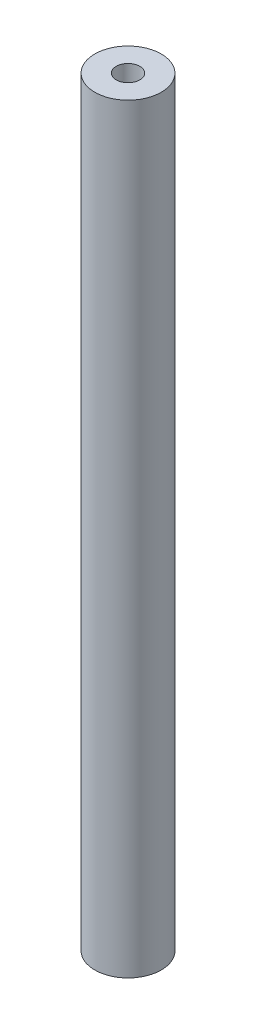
ISO-10303-21;
HEADER;
FILE_DESCRIPTION(('STEP AP214'),'2;1');
FILE_NAME('part.step','',(''),(''),'','','');
FILE_SCHEMA(('AUTOMOTIVE_DESIGN { 1 0 10303 214 1 1 1 1 }'));
ENDSEC;
DATA;
#1=APPLICATION_CONTEXT('core data for automotive mechanical design processes');
#2=APPLICATION_PROTOCOL_DEFINITION('international standard','automotive_design',2000,#1);
#3=PRODUCT_CONTEXT('',#1,'mechanical');
#4=PRODUCT('Part','Part','',(#3));
#5=PRODUCT_RELATED_PRODUCT_CATEGORY('part','',(#4));
#6=PRODUCT_DEFINITION_FORMATION('','',#4);
#7=PRODUCT_DEFINITION_CONTEXT('part definition',#1,'design');
#8=PRODUCT_DEFINITION('design','',#6,#7);
#9=PRODUCT_DEFINITION_SHAPE('','',#8);
#10=(LENGTH_UNIT() NAMED_UNIT(*) SI_UNIT(.MILLI.,.METRE.));
#11=(NAMED_UNIT(*) PLANE_ANGLE_UNIT() SI_UNIT($,.RADIAN.));
#12=(NAMED_UNIT(*) SI_UNIT($,.STERADIAN.) SOLID_ANGLE_UNIT());
#13=UNCERTAINTY_MEASURE_WITH_UNIT(LENGTH_MEASURE(1.E-05),#10,'distance_accuracy_value','');
#14=(GEOMETRIC_REPRESENTATION_CONTEXT(3) GLOBAL_UNCERTAINTY_ASSIGNED_CONTEXT((#13)) GLOBAL_UNIT_ASSIGNED_CONTEXT((#10,
#11,#12)) REPRESENTATION_CONTEXT('',''));
#15=CARTESIAN_POINT('',(0.,0.,0.));
#16=DIRECTION('',(0.,0.,1.));
#17=DIRECTION('',(1.,0.,0.));
#18=AXIS2_PLACEMENT_3D('',#15,#16,#17);
#19=CARTESIAN_POINT('',(-35.,122.727922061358,-148.));
#20=DIRECTION('',(0.,-1.,0.));
#21=DIRECTION('',(0.,0.,-1.));
#22=AXIS2_PLACEMENT_3D('',#19,#20,#21);
#23=CYLINDRICAL_SURFACE('',#22,4.50000000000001);
#24=CARTESIAN_POINT('',(-35.,6.99999999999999,-148.));
#25=DIRECTION('',(0.,1.,0.));
#26=DIRECTION('',(0.,0.,1.));
#27=AXIS2_PLACEMENT_3D('',#24,#25,#26);
#28=CIRCLE('',#27,4.50000000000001);
#29=CARTESIAN_POINT('',(-35.,6.99999999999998,-152.5));
#30=VERTEX_POINT('',#29);
#31=EDGE_CURVE('E43',#30,#30,#28,.T.);
#32=CARTESIAN_POINT('',(-35.,110.,-148.));
#33=DIRECTION('',(0.,1.,0.));
#34=DIRECTION('',(0.,0.,1.));
#35=AXIS2_PLACEMENT_3D('',#32,#33,#34);
#36=CIRCLE('',#35,4.50000000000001);
#37=CARTESIAN_POINT('',(-35.,110.,-152.5));
#38=VERTEX_POINT('',#37);
#39=EDGE_CURVE('E12',#38,#38,#36,.T.);
#40=CARTESIAN_POINT('',(-35.,6.99999999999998,-152.5));
#41=CARTESIAN_POINT('',(-35.,8.07291666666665,-152.5));
#42=CARTESIAN_POINT('',(-35.,9.14583333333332,-152.5));
#43=CARTESIAN_POINT('',(-35.,11.2916666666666,-152.5));
#44=CARTESIAN_POINT('',(-35.,12.3645833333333,-152.5));
#45=CARTESIAN_POINT('',(-35.,14.5104166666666,-152.5));
#46=CARTESIAN_POINT('',(-35.,15.5833333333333,-152.5));
#47=CARTESIAN_POINT('',(-35.,17.7291666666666,-152.5));
#48=CARTESIAN_POINT('',(-35.,18.8020833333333,-152.5));
#49=CARTESIAN_POINT('',(-35.,20.9479166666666,-152.5));
#50=CARTESIAN_POINT('',(-35.,22.0208333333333,-152.5));
#51=CARTESIAN_POINT('',(-35.,24.1666666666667,-152.5));
#52=CARTESIAN_POINT('',(-35.,25.2395833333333,-152.5));
#53=CARTESIAN_POINT('',(-35.,27.3854166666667,-152.5));
#54=CARTESIAN_POINT('',(-35.,28.4583333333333,-152.5));
#55=CARTESIAN_POINT('',(-35.,30.6041666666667,-152.5));
#56=CARTESIAN_POINT('',(-35.,31.6770833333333,-152.5));
#57=CARTESIAN_POINT('',(-35.,33.8229166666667,-152.5));
#58=CARTESIAN_POINT('',(-35.,34.8958333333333,-152.5));
#59=CARTESIAN_POINT('',(-35.,37.0416666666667,-152.5));
#60=CARTESIAN_POINT('',(-35.,38.1145833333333,-152.5));
#61=CARTESIAN_POINT('',(-35.,40.2604166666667,-152.5));
#62=CARTESIAN_POINT('',(-35.,41.3333333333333,-152.5));
#63=CARTESIAN_POINT('',(-35.,43.4791666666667,-152.5));
#64=CARTESIAN_POINT('',(-35.,44.5520833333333,-152.5));
#65=CARTESIAN_POINT('',(-35.,46.6979166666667,-152.5));
#66=CARTESIAN_POINT('',(-35.,47.7708333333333,-152.5));
#67=CARTESIAN_POINT('',(-35.,49.9166666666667,-152.5));
#68=CARTESIAN_POINT('',(-35.,50.9895833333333,-152.5));
#69=CARTESIAN_POINT('',(-35.,53.1354166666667,-152.5));
#70=CARTESIAN_POINT('',(-35.,54.2083333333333,-152.5));
#71=CARTESIAN_POINT('',(-35.,56.3541666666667,-152.5));
#72=CARTESIAN_POINT('',(-35.,57.4270833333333,-152.5));
#73=CARTESIAN_POINT('',(-35.,59.5729166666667,-152.5));
#74=CARTESIAN_POINT('',(-35.,60.6458333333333,-152.5));
#75=CARTESIAN_POINT('',(-35.,62.7916666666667,-152.5));
#76=CARTESIAN_POINT('',(-35.,63.8645833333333,-152.5));
#77=CARTESIAN_POINT('',(-35.,66.0104166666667,-152.5));
#78=CARTESIAN_POINT('',(-35.,67.0833333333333,-152.5));
#79=CARTESIAN_POINT('',(-35.,69.2291666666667,-152.5));
#80=CARTESIAN_POINT('',(-35.,70.3020833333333,-152.5));
#81=CARTESIAN_POINT('',(-35.,72.4479166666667,-152.5));
#82=CARTESIAN_POINT('',(-35.,73.5208333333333,-152.5));
#83=CARTESIAN_POINT('',(-35.,75.6666666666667,-152.5));
#84=CARTESIAN_POINT('',(-35.,76.7395833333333,-152.5));
#85=CARTESIAN_POINT('',(-35.,78.8854166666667,-152.5));
#86=CARTESIAN_POINT('',(-35.,79.9583333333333,-152.5));
#87=CARTESIAN_POINT('',(-35.,82.1041666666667,-152.5));
#88=CARTESIAN_POINT('',(-35.,83.1770833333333,-152.5));
#89=CARTESIAN_POINT('',(-35.,85.3229166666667,-152.5));
#90=CARTESIAN_POINT('',(-35.,86.3958333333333,-152.5));
#91=CARTESIAN_POINT('',(-35.,88.5416666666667,-152.5));
#92=CARTESIAN_POINT('',(-35.,89.6145833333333,-152.5));
#93=CARTESIAN_POINT('',(-35.,91.7604166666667,-152.5));
#94=CARTESIAN_POINT('',(-35.,92.8333333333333,-152.5));
#95=CARTESIAN_POINT('',(-35.,94.9791666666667,-152.5));
#96=CARTESIAN_POINT('',(-35.,96.0520833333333,-152.5));
#97=CARTESIAN_POINT('',(-35.,98.1979166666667,-152.5));
#98=CARTESIAN_POINT('',(-35.,99.2708333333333,-152.5));
#99=CARTESIAN_POINT('',(-35.,101.416666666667,-152.5));
#100=CARTESIAN_POINT('',(-35.,102.489583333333,-152.5));
#101=CARTESIAN_POINT('',(-35.,104.635416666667,-152.5));
#102=CARTESIAN_POINT('',(-35.,105.708333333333,-152.5));
#103=CARTESIAN_POINT('',(-35.,107.854166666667,-152.5));
#104=CARTESIAN_POINT('',(-35.,108.927083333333,-152.5));
#105=CARTESIAN_POINT('',(-35.,110.,-152.5));
#106=B_SPLINE_CURVE_WITH_KNOTS('',3,(#40,#41,#42,#43,#44,#45,#46,#47,#48,#49,#50,#51,#52,#53,
#54,#55,#56,#57,#58,#59,#60,#61,#62,#63,#64,#65,#66,#67,#68,#69,#70,#71,#72,#73,#74,#75,#76,#77,
#78,#79,#80,#81,#82,#83,#84,#85,#86,#87,#88,#89,#90,#91,#92,#93,#94,#95,#96,#97,#98,#99,#100,
#101,#102,#103,#104,#105),.UNSPECIFIED.,.F.,.F.,(4,2,2,2,2,2,2,2,2,2,2,2,2,2,2,2,2,2,2,2,2,2,2,
2,2,2,2,2,2,2,2,2,4),(0.,3.21875000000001,6.4375,9.65625000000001,12.875,16.09375,19.3125,
22.53125,25.75,28.96875,32.1875,35.40625,38.625,41.84375,45.0625,48.28125,51.5,54.71875,57.9375,
61.15625,64.375,67.59375,70.8125,74.03125,77.25,80.46875,83.6875,86.90625,90.125,93.34375,
96.5625,99.78125,103.),.UNSPECIFIED.);
#107=EDGE_CURVE('BSEAM33',#30,#38,#106,.T.);
#108=ORIENTED_EDGE('',*,*,#31,.T.);
#109=ORIENTED_EDGE('',*,*,#39,.F.);
#110=ORIENTED_EDGE('',*,*,#107,.T.);
#111=ORIENTED_EDGE('',*,*,#107,.F.);
#112=EDGE_LOOP('',(#108,#110,#109,#111));
#113=FACE_BOUND('',#112,.T.);
#114=ADVANCED_FACE('F33',(#113),#23,.T.);
#115=CARTESIAN_POINT('',(-35.,7.,-148.));
#116=DIRECTION('',(0.,1.,0.));
#117=DIRECTION('',(0.,0.,1.));
#118=AXIS2_PLACEMENT_3D('',#115,#116,#117);
#119=PLANE('',#118);
#120=CARTESIAN_POINT('',(-35.,7.,-148.));
#121=DIRECTION('',(0.,1.,0.));
#122=DIRECTION('',(0.,0.,1.));
#123=AXIS2_PLACEMENT_3D('',#120,#121,#122);
#124=CIRCLE('',#123,1.6);
#125=CARTESIAN_POINT('',(-35.,7.,-146.4));
#126=VERTEX_POINT('',#125);
#127=EDGE_CURVE('E63',#126,#126,#124,.T.);
#128=ORIENTED_EDGE('',*,*,#127,.T.);
#129=EDGE_LOOP('',(#128));
#130=FACE_BOUND('',#129,.T.);
#131=ORIENTED_EDGE('',*,*,#31,.F.);
#132=EDGE_LOOP('',(#131));
#133=FACE_BOUND('',#132,.T.);
#134=ADVANCED_FACE('F72',(#130,#133),#119,.F.);
#135=CARTESIAN_POINT('',(-225.,110.,-20.0000000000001));
#136=DIRECTION('',(0.,1.,0.));
#137=DIRECTION('',(0.,0.,1.));
#138=AXIS2_PLACEMENT_3D('',#135,#136,#137);
#139=PLANE('',#138);
#140=CARTESIAN_POINT('',(-35.,110.,-148.));
#141=DIRECTION('',(0.,1.,0.));
#142=DIRECTION('',(0.,0.,1.));
#143=AXIS2_PLACEMENT_3D('',#140,#141,#142);
#144=CIRCLE('',#143,1.6);
#145=CARTESIAN_POINT('',(-35.,110.,-146.4));
#146=VERTEX_POINT('',#145);
#147=EDGE_CURVE('E56',#146,#146,#144,.T.);
#148=ORIENTED_EDGE('',*,*,#147,.F.);
#149=EDGE_LOOP('',(#148));
#150=FACE_BOUND('',#149,.T.);
#151=ORIENTED_EDGE('',*,*,#39,.T.);
#152=EDGE_LOOP('',(#151));
#153=FACE_BOUND('',#152,.T.);
#154=ADVANCED_FACE('F74',(#150,#153),#139,.T.);
#155=CARTESIAN_POINT('',(-35.,0.,-148.));
#156=DIRECTION('',(0.,-1.,0.));
#157=DIRECTION('',(0.,0.,-1.));
#158=AXIS2_PLACEMENT_3D('',#155,#156,#157);
#159=CYLINDRICAL_SURFACE('',#158,1.6);
#160=CARTESIAN_POINT('',(-35.,21.1666333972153,-148.));
#161=DIRECTION('',(0.,-1.,0.));
#162=DIRECTION('',(0.,0.,-1.));
#163=AXIS2_PLACEMENT_3D('',#160,#161,#162);
#164=CIRCLE('',#163,1.6);
#165=CARTESIAN_POINT('',(-35.,21.1666333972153,-149.6));
#166=VERTEX_POINT('',#165);
#167=EDGE_CURVE('E58',#166,#166,#164,.T.);
#168=ORIENTED_EDGE('',*,*,#167,.F.);
#169=EDGE_LOOP('',(#168));
#170=FACE_BOUND('',#169,.T.);
#171=ORIENTED_EDGE('',*,*,#127,.F.);
#172=EDGE_LOOP('',(#171));
#173=FACE_BOUND('',#172,.T.);
#174=ADVANCED_FACE('F81',(#170,#173),#159,.F.);
#175=CARTESIAN_POINT('',(-35.,20.8571673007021,-148.));
#176=DIRECTION('',(0.,-1.,0.));
#177=DIRECTION('',(0.,0.,-1.));
#178=AXIS2_PLACEMENT_3D('',#175,#176,#177);
#179=CONICAL_SURFACE('',#178,2.11503807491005,1.02974425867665);
#180=CARTESIAN_POINT('',(-35.,22.1280103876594,-148.));
#181=VERTEX_POINT('',#180);
#182=VERTEX_LOOP('',#181);
#183=FACE_BOUND('',#182,.T.);
#184=ORIENTED_EDGE('',*,*,#167,.T.);
#185=EDGE_LOOP('',(#184));
#186=FACE_BOUND('',#185,.T.);
#187=ADVANCED_FACE('F52',(#183,#186),#179,.F.);
#188=CARTESIAN_POINT('',(-35.,98.1428326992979,-148.));
#189=DIRECTION('',(0.,1.,0.));
#190=DIRECTION('',(0.,0.,1.));
#191=AXIS2_PLACEMENT_3D('',#188,#189,#190);
#192=CONICAL_SURFACE('',#191,2.11503807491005,1.02974425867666);
#193=CARTESIAN_POINT('',(-35.,96.8719896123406,-148.));
#194=VERTEX_POINT('',#193);
#195=VERTEX_LOOP('',#194);
#196=FACE_BOUND('',#195,.T.);
#197=CARTESIAN_POINT('',(-35.,97.8333666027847,-148.));
#198=DIRECTION('',(0.,1.,0.));
#199=DIRECTION('',(0.,0.,1.));
#200=AXIS2_PLACEMENT_3D('',#197,#198,#199);
#201=CIRCLE('',#200,1.6);
#202=CARTESIAN_POINT('',(-35.,97.8333666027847,-146.4));
#203=VERTEX_POINT('',#202);
#204=EDGE_CURVE('E37',#203,#203,#201,.T.);
#205=ORIENTED_EDGE('',*,*,#204,.T.);
#206=EDGE_LOOP('',(#205));
#207=FACE_BOUND('',#206,.T.);
#208=ADVANCED_FACE('F35',(#196,#207),#192,.F.);
#209=CARTESIAN_POINT('',(-35.,119.,-148.));
#210=DIRECTION('',(0.,1.,0.));
#211=DIRECTION('',(0.,0.,1.));
#212=AXIS2_PLACEMENT_3D('',#209,#210,#211);
#213=CYLINDRICAL_SURFACE('',#212,1.6);
#214=ORIENTED_EDGE('',*,*,#147,.T.);
#215=EDGE_LOOP('',(#214));
#216=FACE_BOUND('',#215,.T.);
#217=ORIENTED_EDGE('',*,*,#204,.F.);
#218=EDGE_LOOP('',(#217));
#219=FACE_BOUND('',#218,.T.);
#220=ADVANCED_FACE('F51',(#216,#219),#213,.F.);
#221=CLOSED_SHELL('',(#114,#134,#154,#174,#187,#208,#220));
#222=MANIFOLD_SOLID_BREP('B2',#221);
#223=ADVANCED_BREP_SHAPE_REPRESENTATION('',(#18,#222),#14);
#224=SHAPE_DEFINITION_REPRESENTATION(#9,#223);
ENDSEC;
END-ISO-10303-21;
